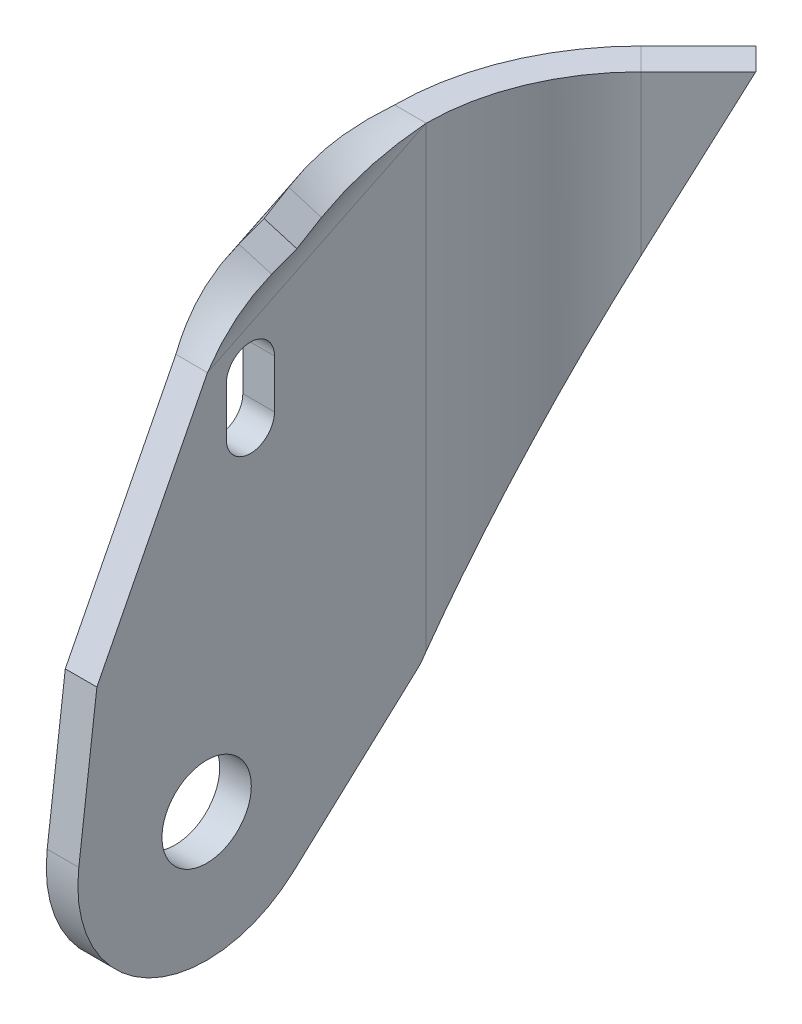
ISO-10303-21;
HEADER;
FILE_DESCRIPTION(('STEP AP214'),'2;1');
FILE_NAME('part.step','',(''),(''),'','','');
FILE_SCHEMA(('AUTOMOTIVE_DESIGN { 1 0 10303 214 1 1 1 1 }'));
ENDSEC;
DATA;
#1=APPLICATION_CONTEXT('core data for automotive mechanical design processes');
#2=APPLICATION_PROTOCOL_DEFINITION('international standard','automotive_design',2000,#1);
#3=PRODUCT_CONTEXT('',#1,'mechanical');
#4=PRODUCT('Part','Part','',(#3));
#5=PRODUCT_RELATED_PRODUCT_CATEGORY('part','',(#4));
#6=PRODUCT_DEFINITION_FORMATION('','',#4);
#7=PRODUCT_DEFINITION_CONTEXT('part definition',#1,'design');
#8=PRODUCT_DEFINITION('design','',#6,#7);
#9=PRODUCT_DEFINITION_SHAPE('','',#8);
#10=(LENGTH_UNIT() NAMED_UNIT(*) SI_UNIT(.MILLI.,.METRE.));
#11=(NAMED_UNIT(*) PLANE_ANGLE_UNIT() SI_UNIT($,.RADIAN.));
#12=(NAMED_UNIT(*) SI_UNIT($,.STERADIAN.) SOLID_ANGLE_UNIT());
#13=UNCERTAINTY_MEASURE_WITH_UNIT(LENGTH_MEASURE(1.E-05),#10,'distance_accuracy_value','');
#14=(GEOMETRIC_REPRESENTATION_CONTEXT(3) GLOBAL_UNCERTAINTY_ASSIGNED_CONTEXT((#13)) GLOBAL_UNIT_ASSIGNED_CONTEXT((#10,
#11,#12)) REPRESENTATION_CONTEXT('',''));
#15=CARTESIAN_POINT('',(0.,0.,0.));
#16=DIRECTION('',(0.,0.,1.));
#17=DIRECTION('',(1.,0.,0.));
#18=AXIS2_PLACEMENT_3D('',#15,#16,#17);
#19=CARTESIAN_POINT('',(0.,-91.0082,64.6682441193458));
#20=DIRECTION('',(1.,0.,0.));
#21=DIRECTION('',(0.,0.,-1.));
#22=AXIS2_PLACEMENT_3D('',#19,#20,#21);
#23=PLANE('',#22);
#24=CARTESIAN_POINT('',(0.,-71.9582,45.6182441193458));
#25=DIRECTION('',(1.,0.,0.));
#26=DIRECTION('',(0.,0.,-1.));
#27=AXIS2_PLACEMENT_3D('',#24,#25,#26);
#28=CIRCLE('',#27,6.604);
#29=CARTESIAN_POINT('',(0.,-71.9582,39.0142441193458));
#30=VERTEX_POINT('',#29);
#31=EDGE_CURVE('E816',#30,#30,#28,.T.);
#32=ORIENTED_EDGE('',*,*,#31,.F.);
#33=EDGE_LOOP('',(#32));
#34=FACE_BOUND('',#33,.T.);
#35=CARTESIAN_POINT('',(0.,-25.7556,39.1511237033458));
#36=DIRECTION('',(1.,0.,0.));
#37=DIRECTION('',(0.,0.,-1.));
#38=AXIS2_PLACEMENT_3D('',#35,#36,#37);
#39=CIRCLE('',#38,3.556);
#40=CARTESIAN_POINT('',(0.,-25.7556,42.7071237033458));
#41=VERTEX_POINT('',#40);
#42=CARTESIAN_POINT('',(0.,-25.7556,35.5951237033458));
#43=VERTEX_POINT('',#42);
#44=EDGE_CURVE('E776',#41,#43,#39,.T.);
#45=ORIENTED_EDGE('',*,*,#44,.F.);
#46=DIRECTION('',(0.,-1.,0.));
#47=VECTOR('',#46,1.);
#48=CARTESIAN_POINT('',(0.,-91.0082,42.7071237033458));
#49=LINE('',#48,#47);
#50=CARTESIAN_POINT('',(0.,-18.5928,42.7071237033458));
#51=VERTEX_POINT('',#50);
#52=EDGE_CURVE('E774',#51,#41,#49,.T.);
#53=ORIENTED_EDGE('',*,*,#52,.F.);
#54=CARTESIAN_POINT('',(0.,-18.5928,39.1511237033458));
#55=DIRECTION('',(1.,0.,0.));
#56=DIRECTION('',(0.,0.,-1.));
#57=AXIS2_PLACEMENT_3D('',#54,#55,#56);
#58=CIRCLE('',#57,3.556);
#59=CARTESIAN_POINT('',(0.,-18.5928,35.5951237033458));
#60=VERTEX_POINT('',#59);
#61=EDGE_CURVE('E772',#60,#51,#58,.T.);
#62=ORIENTED_EDGE('',*,*,#61,.F.);
#63=DIRECTION('',(0.,1.,0.));
#64=VECTOR('',#63,1.);
#65=CARTESIAN_POINT('',(0.,-91.0082,35.5951237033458));
#66=LINE('',#65,#64);
#67=EDGE_CURVE('E769',#43,#60,#66,.T.);
#68=ORIENTED_EDGE('',*,*,#67,.F.);
#69=EDGE_LOOP('',(#45,#53,#62,#68));
#70=FACE_BOUND('',#69,.T.);
#71=DIRECTION('',(0.,-0.675178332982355,0.737654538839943));
#72=VECTOR('',#71,1.);
#73=CARTESIAN_POINT('',(0.,-104.182583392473,52.6096750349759));
#74=LINE('',#73,#72);
#75=CARTESIAN_POINT('',(0.,-68.8898703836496,14.05122511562));
#76=VERTEX_POINT('',#75);
#77=CARTESIAN_POINT('',(0.,-86.0105189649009,32.756096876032));
#78=VERTEX_POINT('',#77);
#79=EDGE_CURVE('E757',#76,#78,#74,.T.);
#80=ORIENTED_EDGE('',*,*,#79,.F.);
#81=DIRECTION('',(0.,-0.811311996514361,0.584613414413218));
#82=VECTOR('',#81,1.);
#83=CARTESIAN_POINT('',(0.,-107.456603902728,41.8415571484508));
#84=LINE('',#83,#82);
#85=CARTESIAN_POINT('',(0.,-67.6409497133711,13.1512806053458));
#86=VERTEX_POINT('',#85);
#87=EDGE_CURVE('E430',#86,#76,#84,.T.);
#88=ORIENTED_EDGE('',*,*,#87,.F.);
#89=DIRECTION('',(0.,1.,0.));
#90=VECTOR('',#89,1.);
#91=CARTESIAN_POINT('',(0.,-91.0082,13.1512806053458));
#92=LINE('',#91,#90);
#93=CARTESIAN_POINT('',(0.,0.,13.1512806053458));
#94=VERTEX_POINT('',#93);
#95=EDGE_CURVE('E417',#86,#94,#92,.T.);
#96=ORIENTED_EDGE('',*,*,#95,.T.);
#97=DIRECTION('',(0.,-0.438371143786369,0.898794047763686));
#98=VECTOR('',#97,1.);
#99=CARTESIAN_POINT('',(0.,-37.7869389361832,90.6259873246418));
#100=LINE('',#99,#98);
#101=CARTESIAN_POINT('',(0.,-15.7774248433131,45.4997956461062));
#102=VERTEX_POINT('',#101);
#103=EDGE_CURVE('E423',#94,#102,#100,.T.);
#104=ORIENTED_EDGE('',*,*,#103,.T.);
#105=DIRECTION('',(0.,0.891006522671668,-0.453990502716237));
#106=VECTOR('',#105,1.);
#107=CARTESIAN_POINT('',(0.,-83.2563826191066,79.8820422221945));
#108=LINE('',#107,#106);
#109=CARTESIAN_POINT('',(0.,-47.874829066,61.8542400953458));
#110=VERTEX_POINT('',#109);
#111=EDGE_CURVE('E805',#110,#102,#108,.T.);
#112=ORIENTED_EDGE('',*,*,#111,.F.);
#113=DIRECTION('',(0.,0.992546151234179,-0.121869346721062));
#114=VECTOR('',#113,1.);
#115=CARTESIAN_POINT('',(0.,-90.707961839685,67.1134876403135));
#116=LINE('',#115,#114);
#117=CARTESIAN_POINT('',(0.,-69.6365889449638,64.5262483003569));
#118=VERTEX_POINT('',#117);
#119=EDGE_CURVE('E803',#118,#110,#116,.T.);
#120=ORIENTED_EDGE('',*,*,#119,.F.);
#121=CARTESIAN_POINT('',(0.,-71.9582,45.6182441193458));
#122=DIRECTION('',(1.,0.,0.));
#123=DIRECTION('',(0.,0.,-1.));
#124=AXIS2_PLACEMENT_3D('',#121,#122,#123);
#125=CIRCLE('',#124,19.05);
#126=EDGE_CURVE('E799',#78,#118,#125,.F.);
#127=ORIENTED_EDGE('',*,*,#126,.F.);
#128=EDGE_LOOP('',(#80,#88,#96,#104,#112,#120,#127));
#129=FACE_BOUND('',#128,.T.);
#130=ADVANCED_FACE('F414',(#34,#70,#129),#23,.T.);
#131=CARTESIAN_POINT('',(-4.6736,-91.0082,64.6682441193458));
#132=DIRECTION('',(1.,0.,0.));
#133=DIRECTION('',(0.,0.,-1.));
#134=AXIS2_PLACEMENT_3D('',#131,#132,#133);
#135=PLANE('',#134);
#136=DIRECTION('',(0.,1.,0.));
#137=VECTOR('',#136,1.);
#138=CARTESIAN_POINT('',(-4.6736,-91.0082,42.7071237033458));
#139=LINE('',#138,#137);
#140=CARTESIAN_POINT('',(-4.6736,-18.5928,42.7071237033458));
#141=VERTEX_POINT('',#140);
#142=CARTESIAN_POINT('',(-4.6736,-25.7556,42.7071237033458));
#143=VERTEX_POINT('',#142);
#144=EDGE_CURVE('E786',#141,#143,#139,.F.);
#145=ORIENTED_EDGE('',*,*,#144,.T.);
#146=CARTESIAN_POINT('',(-4.6736,-25.7556,39.1511237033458));
#147=DIRECTION('',(1.,0.,0.));
#148=DIRECTION('',(0.,0.,-1.));
#149=AXIS2_PLACEMENT_3D('',#146,#147,#148);
#150=CIRCLE('',#149,3.556);
#151=CARTESIAN_POINT('',(-4.6736,-25.7556,35.5951237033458));
#152=VERTEX_POINT('',#151);
#153=EDGE_CURVE('E782',#143,#152,#150,.T.);
#154=ORIENTED_EDGE('',*,*,#153,.T.);
#155=DIRECTION('',(0.,1.,0.));
#156=VECTOR('',#155,1.);
#157=CARTESIAN_POINT('',(-4.6736,-91.0082,35.5951237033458));
#158=LINE('',#157,#156);
#159=CARTESIAN_POINT('',(-4.6736,-18.5928,35.5951237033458));
#160=VERTEX_POINT('',#159);
#161=EDGE_CURVE('E778',#152,#160,#158,.T.);
#162=ORIENTED_EDGE('',*,*,#161,.T.);
#163=CARTESIAN_POINT('',(-4.6736,-18.5928,39.1511237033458));
#164=DIRECTION('',(1.,0.,0.));
#165=DIRECTION('',(0.,0.,-1.));
#166=AXIS2_PLACEMENT_3D('',#163,#164,#165);
#167=CIRCLE('',#166,3.556);
#168=EDGE_CURVE('E781',#160,#141,#167,.T.);
#169=ORIENTED_EDGE('',*,*,#168,.T.);
#170=EDGE_LOOP('',(#145,#154,#162,#169));
#171=FACE_BOUND('',#170,.T.);
#172=CARTESIAN_POINT('',(-4.6736,-71.9582,45.6182441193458));
#173=DIRECTION('',(1.,0.,0.));
#174=DIRECTION('',(0.,0.,-1.));
#175=AXIS2_PLACEMENT_3D('',#172,#173,#174);
#176=CIRCLE('',#175,6.604);
#177=CARTESIAN_POINT('',(-4.6736,-71.9582,39.0142441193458));
#178=VERTEX_POINT('',#177);
#179=EDGE_CURVE('E819',#178,#178,#176,.T.);
#180=ORIENTED_EDGE('',*,*,#179,.T.);
#181=EDGE_LOOP('',(#180));
#182=FACE_BOUND('',#181,.T.);
#183=DIRECTION('',(0.,-0.811311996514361,0.584613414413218));
#184=VECTOR('',#183,1.);
#185=CARTESIAN_POINT('',(-4.6736,-107.456603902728,41.8415571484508));
#186=LINE('',#185,#184);
#187=CARTESIAN_POINT('',(-4.6736,-67.6409497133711,13.1512806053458));
#188=VERTEX_POINT('',#187);
#189=CARTESIAN_POINT('',(-4.6736,-68.8898703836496,14.05122511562));
#190=VERTEX_POINT('',#189);
#191=EDGE_CURVE('E532',#188,#190,#186,.T.);
#192=ORIENTED_EDGE('',*,*,#191,.T.);
#193=DIRECTION('',(0.,-0.675178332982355,0.737654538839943));
#194=VECTOR('',#193,1.);
#195=CARTESIAN_POINT('',(-4.6736,-104.182583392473,52.6096750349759));
#196=LINE('',#195,#194);
#197=CARTESIAN_POINT('',(-4.6736,-86.0105189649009,32.756096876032));
#198=VERTEX_POINT('',#197);
#199=EDGE_CURVE('E764',#190,#198,#196,.T.);
#200=ORIENTED_EDGE('',*,*,#199,.T.);
#201=CARTESIAN_POINT('',(-4.6736,-71.9582,45.6182441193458));
#202=DIRECTION('',(1.,0.,0.));
#203=DIRECTION('',(0.,0.,-1.));
#204=AXIS2_PLACEMENT_3D('',#201,#202,#203);
#205=CIRCLE('',#204,19.05);
#206=CARTESIAN_POINT('',(-4.6736,-69.6365889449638,64.5262483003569));
#207=VERTEX_POINT('',#206);
#208=EDGE_CURVE('E808',#198,#207,#205,.F.);
#209=ORIENTED_EDGE('',*,*,#208,.T.);
#210=DIRECTION('',(0.,0.992546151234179,-0.121869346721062));
#211=VECTOR('',#210,1.);
#212=CARTESIAN_POINT('',(-4.6736,-90.707961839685,67.1134876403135));
#213=LINE('',#212,#211);
#214=CARTESIAN_POINT('',(-4.6736,-47.874829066,61.8542400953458));
#215=VERTEX_POINT('',#214);
#216=EDGE_CURVE('E626',#207,#215,#213,.T.);
#217=ORIENTED_EDGE('',*,*,#216,.T.);
#218=DIRECTION('',(0.,0.891006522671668,-0.453990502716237));
#219=VECTOR('',#218,1.);
#220=CARTESIAN_POINT('',(-4.6736,-83.2563826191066,79.8820422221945));
#221=LINE('',#220,#219);
#222=CARTESIAN_POINT('',(-4.6736,-15.7774248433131,45.4997956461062));
#223=VERTEX_POINT('',#222);
#224=EDGE_CURVE('E618',#215,#223,#221,.T.);
#225=ORIENTED_EDGE('',*,*,#224,.T.);
#226=DIRECTION('',(0.,-0.438371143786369,0.898794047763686));
#227=VECTOR('',#226,1.);
#228=CARTESIAN_POINT('',(-4.6736,-37.7869389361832,90.6259873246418));
#229=LINE('',#228,#227);
#230=CARTESIAN_POINT('',(-4.67360000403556,0.,13.1512806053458));
#231=VERTEX_POINT('',#230);
#232=EDGE_CURVE('E561',#231,#223,#229,.T.);
#233=ORIENTED_EDGE('',*,*,#232,.F.);
#234=DIRECTION('',(0.,1.,0.));
#235=VECTOR('',#234,1.);
#236=CARTESIAN_POINT('',(-4.6736,-91.0082,13.1512806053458));
#237=LINE('',#236,#235);
#238=EDGE_CURVE('E554',#188,#231,#237,.T.);
#239=ORIENTED_EDGE('',*,*,#238,.F.);
#240=EDGE_LOOP('',(#192,#200,#209,#217,#225,#233,#239));
#241=FACE_BOUND('',#240,.T.);
#242=ADVANCED_FACE('F559',(#171,#182,#241),#135,.F.);
#243=CARTESIAN_POINT('',(0.,-91.0082,0.));
#244=DIRECTION('',(0.707106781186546,0.,0.707106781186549));
#245=DIRECTION('',(0.707106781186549,0.,-0.707106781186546));
#246=AXIS2_PLACEMENT_3D('',#243,#244,#245);
#247=PLANE('',#246);
#248=DIRECTION('',(0.,1.,0.));
#249=VECTOR('',#248,1.);
#250=CARTESIAN_POINT('',(9.29935969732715,-91.0082,-9.29935969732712));
#251=LINE('',#250,#249);
#252=CARTESIAN_POINT('',(9.29935969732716,-23.5790872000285,-9.29935969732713));
#253=VERTEX_POINT('',#252);
#254=CARTESIAN_POINT('',(9.29935969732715,0.,-9.29935969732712));
#255=VERTEX_POINT('',#254);
#256=EDGE_CURVE('E562',#253,#255,#251,.T.);
#257=ORIENTED_EDGE('',*,*,#256,.F.);
#258=DIRECTION('',(-0.321019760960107,-0.891006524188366,0.321019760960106));
#259=VECTOR('',#258,1.);
#260=CARTESIAN_POINT('',(-11.9041033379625,-82.4303673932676,11.9041033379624));
#261=LINE('',#260,#259);
#262=CARTESIAN_POINT('',(17.7946431,0.,-17.7946430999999));
#263=VERTEX_POINT('',#262);
#264=EDGE_CURVE('E891',#263,#253,#261,.T.);
#265=ORIENTED_EDGE('',*,*,#264,.F.);
#266=DIRECTION('',(0.707106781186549,0.,-0.707106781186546));
#267=VECTOR('',#266,1.);
#268=CARTESIAN_POINT('',(0.,0.,0.));
#269=LINE('',#268,#267);
#270=EDGE_CURVE('E822',#255,#263,#269,.T.);
#271=ORIENTED_EDGE('',*,*,#270,.F.);
#272=EDGE_LOOP('',(#257,#265,#271));
#273=FACE_BOUND('',#272,.T.);
#274=ADVANCED_FACE('F603',(#273),#247,.T.);
#275=CARTESIAN_POINT('',(31.75,-91.0082,13.1512806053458));
#276=DIRECTION('',(0.,1.,0.));
#277=DIRECTION('',(0.,0.,1.));
#278=AXIS2_PLACEMENT_3D('',#275,#276,#277);
#279=CYLINDRICAL_SURFACE('',#278,31.75);
#280=ORIENTED_EDGE('',*,*,#95,.F.);
#281=CARTESIAN_POINT('',(31.75,-23.5790872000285,13.1512806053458));
#282=DIRECTION('',(-0.63003675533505,0.453990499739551,0.630036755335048));
#283=DIRECTION('',(0.321019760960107,0.891006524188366,-0.321019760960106));
#284=AXIS2_PLACEMENT_3D('',#281,#282,#283);
#285=ELLIPSE('',#284,69.9353841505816,31.75);
#286=EDGE_CURVE('E548',#253,#86,#285,.T.);
#287=ORIENTED_EDGE('',*,*,#286,.F.);
#288=ORIENTED_EDGE('',*,*,#256,.T.);
#289=CARTESIAN_POINT('',(31.75,0.,13.1512806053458));
#290=DIRECTION('',(0.,1.,0.));
#291=DIRECTION('',(0.,0.,1.));
#292=AXIS2_PLACEMENT_3D('',#289,#290,#291);
#293=CIRCLE('',#292,31.75);
#294=EDGE_CURVE('E563',#94,#255,#293,.F.);
#295=ORIENTED_EDGE('',*,*,#294,.F.);
#296=EDGE_LOOP('',(#280,#287,#288,#295));
#297=FACE_BOUND('',#296,.T.);
#298=ADVANCED_FACE('F970',(#297),#279,.F.);
#299=CARTESIAN_POINT('',(31.75,-91.0082,13.1512806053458));
#300=DIRECTION('',(0.,1.,0.));
#301=DIRECTION('',(0.,0.,1.));
#302=AXIS2_PLACEMENT_3D('',#299,#300,#301);
#303=CYLINDRICAL_SURFACE('',#302,36.4236);
#304=CARTESIAN_POINT('',(31.75,-23.5790872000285,13.1512806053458));
#305=DIRECTION('',(-0.610466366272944,0.504640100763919,0.610466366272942));
#306=DIRECTION('',(0.35683443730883,0.863329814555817,-0.356834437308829));
#307=AXIS2_PLACEMENT_3D('',#304,#305,#306);
#308=ELLIPSE('',#307,72.1773793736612,36.4236);
#309=CARTESIAN_POINT('',(5.99462544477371,-23.5790872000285,-12.6040939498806));
#310=VERTEX_POINT('',#309);
#311=EDGE_CURVE('E545',#310,#188,#308,.T.);
#312=ORIENTED_EDGE('',*,*,#311,.T.);
#313=ORIENTED_EDGE('',*,*,#238,.T.);
#314=CARTESIAN_POINT('',(31.75,0.,13.1512806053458));
#315=DIRECTION('',(0.,1.,0.));
#316=DIRECTION('',(1.,0.,0.));
#317=AXIS2_PLACEMENT_3D('',#314,#315,#316);
#318=CIRCLE('',#317,36.4236);
#319=CARTESIAN_POINT('',(5.99462544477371,0.,-12.6040939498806));
#320=VERTEX_POINT('',#319);
#321=EDGE_CURVE('E830',#231,#320,#318,.F.);
#322=ORIENTED_EDGE('',*,*,#321,.T.);
#323=DIRECTION('',(0.,1.,0.));
#324=VECTOR('',#323,1.);
#325=CARTESIAN_POINT('',(5.99462544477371,-91.0082,-12.6040939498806));
#326=LINE('',#325,#324);
#327=EDGE_CURVE('E556',#310,#320,#326,.T.);
#328=ORIENTED_EDGE('',*,*,#327,.F.);
#329=EDGE_LOOP('',(#312,#313,#322,#328));
#330=FACE_BOUND('',#329,.T.);
#331=ADVANCED_FACE('F552',(#330),#303,.T.);
#332=CARTESIAN_POINT('',(-3.30473425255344,-91.0082,-3.30473425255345));
#333=DIRECTION('',(0.707106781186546,0.,0.707106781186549));
#334=DIRECTION('',(0.707106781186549,0.,-0.707106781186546));
#335=AXIS2_PLACEMENT_3D('',#332,#333,#334);
#336=PLANE('',#335);
#337=DIRECTION('',(-0.321019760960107,-0.891006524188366,0.321019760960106));
#338=VECTOR('',#337,1.);
#339=CARTESIAN_POINT('',(-15.2088375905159,-82.4303673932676,8.59936908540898));
#340=LINE('',#339,#338);
#341=CARTESIAN_POINT('',(14.4899088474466,0.,-21.0993773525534));
#342=VERTEX_POINT('',#341);
#343=EDGE_CURVE('E886',#342,#310,#340,.T.);
#344=ORIENTED_EDGE('',*,*,#343,.T.);
#345=ORIENTED_EDGE('',*,*,#327,.T.);
#346=DIRECTION('',(0.707106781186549,0.,-0.707106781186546));
#347=VECTOR('',#346,1.);
#348=CARTESIAN_POINT('',(-3.30473425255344,0.,-3.30473425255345));
#349=LINE('',#348,#347);
#350=EDGE_CURVE('E827',#320,#342,#349,.T.);
#351=ORIENTED_EDGE('',*,*,#350,.T.);
#352=EDGE_LOOP('',(#344,#345,#351));
#353=FACE_BOUND('',#352,.T.);
#354=ADVANCED_FACE('F975',(#353),#336,.F.);
#355=CARTESIAN_POINT('',(0.,-104.182583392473,52.6096750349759));
#356=DIRECTION('',(0.,0.737654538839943,0.675178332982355));
#357=DIRECTION('',(0.,-0.675178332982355,0.737654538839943));
#358=AXIS2_PLACEMENT_3D('',#355,#356,#357);
#359=PLANE('',#358);
#360=ORIENTED_EDGE('',*,*,#199,.F.);
#361=DIRECTION('',(1.,0.,0.));
#362=VECTOR('',#361,1.);
#363=CARTESIAN_POINT('',(0.,-68.8898703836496,14.05122511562));
#364=LINE('',#363,#362);
#365=EDGE_CURVE('E537',#76,#190,#364,.F.);
#366=ORIENTED_EDGE('',*,*,#365,.F.);
#367=ORIENTED_EDGE('',*,*,#79,.T.);
#368=DIRECTION('',(1.,0.,0.));
#369=VECTOR('',#368,1.);
#370=CARTESIAN_POINT('',(0.,-86.0105189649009,32.756096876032));
#371=LINE('',#370,#369);
#372=EDGE_CURVE('E766',#78,#198,#371,.F.);
#373=ORIENTED_EDGE('',*,*,#372,.T.);
#374=EDGE_LOOP('',(#360,#366,#367,#373));
#375=FACE_BOUND('',#374,.T.);
#376=ADVANCED_FACE('F609',(#375),#359,.F.);
#377=CARTESIAN_POINT('',(0.,-83.2563826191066,79.8820422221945));
#378=DIRECTION('',(0.,-0.453990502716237,-0.891006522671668));
#379=DIRECTION('',(0.,0.891006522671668,-0.453990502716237));
#380=AXIS2_PLACEMENT_3D('',#377,#378,#379);
#381=PLANE('',#380);
#382=ORIENTED_EDGE('',*,*,#111,.T.);
#383=CARTESIAN_POINT('',(-4.67360000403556,-15.7774248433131,45.4997956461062));
#384=CARTESIAN_POINT('',(-4.03556181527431E-09,-15.7774248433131,45.4997956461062));
#385=B_SPLINE_CURVE_WITH_KNOTS('',1,(#383,#384),.UNSPECIFIED.,.F.,.F.,(2,2),(0.,1.),.UNSPECIFIED.);
#386=EDGE_CURVE('E577',#102,#223,#385,.F.);
#387=ORIENTED_EDGE('',*,*,#386,.T.);
#388=ORIENTED_EDGE('',*,*,#224,.F.);
#389=DIRECTION('',(1.,0.,0.));
#390=VECTOR('',#389,1.);
#391=CARTESIAN_POINT('',(0.,-47.874829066,61.8542400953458));
#392=LINE('',#391,#390);
#393=EDGE_CURVE('E625',#110,#215,#392,.F.);
#394=ORIENTED_EDGE('',*,*,#393,.F.);
#395=EDGE_LOOP('',(#382,#387,#388,#394));
#396=FACE_BOUND('',#395,.T.);
#397=ADVANCED_FACE('F602',(#396),#381,.F.);
#398=CARTESIAN_POINT('',(0.,0.,13.1512806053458));
#399=DIRECTION('',(0.,1.,0.));
#400=DIRECTION('',(0.,0.,1.));
#401=AXIS2_PLACEMENT_3D('',#398,#399,#400);
#402=PLANE('',#401);
#403=CARTESIAN_POINT('',(-4.03556181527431E-09,0.,13.1512806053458));
#404=CARTESIAN_POINT('',(-4.67360000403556,0.,13.1512806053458));
#405=B_SPLINE_CURVE_WITH_KNOTS('',1,(#403,#404),.UNSPECIFIED.,.F.,.F.,(2,2),(0.,1.),.UNSPECIFIED.);
#406=EDGE_CURVE('E12',#94,#231,#405,.T.);
#407=ORIENTED_EDGE('',*,*,#406,.F.);
#408=ORIENTED_EDGE('',*,*,#294,.T.);
#409=DIRECTION('',(0.707106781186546,0.,0.707106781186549));
#410=VECTOR('',#409,1.);
#411=CARTESIAN_POINT('',(5.99462544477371,0.,-12.6040939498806));
#412=LINE('',#411,#410);
#413=EDGE_CURVE('E578',#320,#255,#412,.T.);
#414=ORIENTED_EDGE('',*,*,#413,.F.);
#415=ORIENTED_EDGE('',*,*,#321,.F.);
#416=EDGE_LOOP('',(#407,#408,#414,#415));
#417=FACE_BOUND('',#416,.T.);
#418=ADVANCED_FACE('F591',(#417),#402,.T.);
#419=CARTESIAN_POINT('',(31.75,0.,13.1512806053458));
#420=DIRECTION('',(0.,1.,0.));
#421=DIRECTION('',(0.,0.,1.));
#422=AXIS2_PLACEMENT_3D('',#419,#420,#421);
#423=PLANE('',#422);
#424=ORIENTED_EDGE('',*,*,#270,.T.);
#425=DIRECTION('',(0.707106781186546,0.,0.707106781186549));
#426=VECTOR('',#425,1.);
#427=CARTESIAN_POINT('',(14.4899088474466,0.,-21.0993773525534));
#428=LINE('',#427,#426);
#429=EDGE_CURVE('E825',#342,#263,#428,.T.);
#430=ORIENTED_EDGE('',*,*,#429,.F.);
#431=ORIENTED_EDGE('',*,*,#350,.F.);
#432=ORIENTED_EDGE('',*,*,#413,.T.);
#433=EDGE_LOOP('',(#424,#430,#431,#432));
#434=FACE_BOUND('',#433,.T.);
#435=ADVANCED_FACE('F601',(#434),#423,.T.);
#436=CARTESIAN_POINT('',(0.,-71.9582,45.6182441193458));
#437=DIRECTION('',(1.,0.,0.));
#438=DIRECTION('',(0.,0.,-1.));
#439=AXIS2_PLACEMENT_3D('',#436,#437,#438);
#440=CYLINDRICAL_SURFACE('',#439,6.604);
#441=ORIENTED_EDGE('',*,*,#179,.F.);
#442=EDGE_LOOP('',(#441));
#443=FACE_BOUND('',#442,.T.);
#444=ORIENTED_EDGE('',*,*,#31,.T.);
#445=EDGE_LOOP('',(#444));
#446=FACE_BOUND('',#445,.T.);
#447=ADVANCED_FACE('F959',(#443,#446),#440,.F.);
#448=CARTESIAN_POINT('',(0.,-90.707961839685,67.1134876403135));
#449=DIRECTION('',(0.,-0.121869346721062,-0.992546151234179));
#450=DIRECTION('',(0.,0.992546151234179,-0.121869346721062));
#451=AXIS2_PLACEMENT_3D('',#448,#449,#450);
#452=PLANE('',#451);
#453=DIRECTION('',(1.,0.,0.));
#454=VECTOR('',#453,1.);
#455=CARTESIAN_POINT('',(0.,-69.6365889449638,64.5262483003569));
#456=LINE('',#455,#454);
#457=EDGE_CURVE('E813',#118,#207,#456,.F.);
#458=ORIENTED_EDGE('',*,*,#457,.F.);
#459=ORIENTED_EDGE('',*,*,#119,.T.);
#460=ORIENTED_EDGE('',*,*,#393,.T.);
#461=ORIENTED_EDGE('',*,*,#216,.F.);
#462=EDGE_LOOP('',(#458,#459,#460,#461));
#463=FACE_BOUND('',#462,.T.);
#464=ADVANCED_FACE('F956',(#463),#452,.F.);
#465=CARTESIAN_POINT('',(0.,-71.9582,45.6182441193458));
#466=DIRECTION('',(1.,0.,0.));
#467=DIRECTION('',(0.,0.,-1.));
#468=AXIS2_PLACEMENT_3D('',#465,#466,#467);
#469=CYLINDRICAL_SURFACE('',#468,19.05);
#470=ORIENTED_EDGE('',*,*,#126,.T.);
#471=ORIENTED_EDGE('',*,*,#457,.T.);
#472=ORIENTED_EDGE('',*,*,#208,.F.);
#473=ORIENTED_EDGE('',*,*,#372,.F.);
#474=EDGE_LOOP('',(#470,#471,#472,#473));
#475=FACE_BOUND('',#474,.T.);
#476=ADVANCED_FACE('F958',(#475),#469,.T.);
#477=CARTESIAN_POINT('',(0.,-91.0082,42.7071237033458));
#478=DIRECTION('',(0.,0.,1.));
#479=DIRECTION('',(0.,-1.,0.));
#480=AXIS2_PLACEMENT_3D('',#477,#478,#479);
#481=PLANE('',#480);
#482=DIRECTION('',(1.,0.,0.));
#483=VECTOR('',#482,1.);
#484=CARTESIAN_POINT('',(0.,-18.5928,42.7071237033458));
#485=LINE('',#484,#483);
#486=EDGE_CURVE('E797',#51,#141,#485,.F.);
#487=ORIENTED_EDGE('',*,*,#486,.F.);
#488=ORIENTED_EDGE('',*,*,#52,.T.);
#489=DIRECTION('',(1.,0.,0.));
#490=VECTOR('',#489,1.);
#491=CARTESIAN_POINT('',(0.,-25.7556,42.7071237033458));
#492=LINE('',#491,#490);
#493=EDGE_CURVE('E794',#41,#143,#492,.F.);
#494=ORIENTED_EDGE('',*,*,#493,.T.);
#495=ORIENTED_EDGE('',*,*,#144,.F.);
#496=EDGE_LOOP('',(#487,#488,#494,#495));
#497=FACE_BOUND('',#496,.T.);
#498=ADVANCED_FACE('F942',(#497),#481,.F.);
#499=CARTESIAN_POINT('',(0.,-25.7556,39.1511237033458));
#500=DIRECTION('',(1.,0.,0.));
#501=DIRECTION('',(0.,0.,-1.));
#502=AXIS2_PLACEMENT_3D('',#499,#500,#501);
#503=CYLINDRICAL_SURFACE('',#502,3.556);
#504=ORIENTED_EDGE('',*,*,#493,.F.);
#505=ORIENTED_EDGE('',*,*,#44,.T.);
#506=DIRECTION('',(1.,0.,0.));
#507=VECTOR('',#506,1.);
#508=CARTESIAN_POINT('',(0.,-25.7556,35.5951237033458));
#509=LINE('',#508,#507);
#510=EDGE_CURVE('E791',#43,#152,#509,.F.);
#511=ORIENTED_EDGE('',*,*,#510,.T.);
#512=ORIENTED_EDGE('',*,*,#153,.F.);
#513=EDGE_LOOP('',(#504,#505,#511,#512));
#514=FACE_BOUND('',#513,.T.);
#515=ADVANCED_FACE('F935',(#514),#503,.F.);
#516=CARTESIAN_POINT('',(0.,-91.0082,35.5951237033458));
#517=DIRECTION('',(0.,0.,-1.));
#518=DIRECTION('',(0.,1.,0.));
#519=AXIS2_PLACEMENT_3D('',#516,#517,#518);
#520=PLANE('',#519);
#521=ORIENTED_EDGE('',*,*,#510,.F.);
#522=ORIENTED_EDGE('',*,*,#67,.T.);
#523=DIRECTION('',(1.,0.,0.));
#524=VECTOR('',#523,1.);
#525=CARTESIAN_POINT('',(0.,-18.5928,35.5951237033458));
#526=LINE('',#525,#524);
#527=EDGE_CURVE('E785',#60,#160,#526,.F.);
#528=ORIENTED_EDGE('',*,*,#527,.T.);
#529=ORIENTED_EDGE('',*,*,#161,.F.);
#530=EDGE_LOOP('',(#521,#522,#528,#529));
#531=FACE_BOUND('',#530,.T.);
#532=ADVANCED_FACE('F937',(#531),#520,.F.);
#533=CARTESIAN_POINT('',(0.,-18.5928,39.1511237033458));
#534=DIRECTION('',(1.,0.,0.));
#535=DIRECTION('',(0.,0.,-1.));
#536=AXIS2_PLACEMENT_3D('',#533,#534,#535);
#537=CYLINDRICAL_SURFACE('',#536,3.556);
#538=ORIENTED_EDGE('',*,*,#61,.T.);
#539=ORIENTED_EDGE('',*,*,#486,.T.);
#540=ORIENTED_EDGE('',*,*,#168,.F.);
#541=ORIENTED_EDGE('',*,*,#527,.F.);
#542=EDGE_LOOP('',(#538,#539,#540,#541));
#543=FACE_BOUND('',#542,.T.);
#544=ADVANCED_FACE('F944',(#543),#537,.F.);
#545=CARTESIAN_POINT('',(-1.18971915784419,0.760510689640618,32.2955092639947));
#546=CARTESIAN_POINT('',(-2.29857887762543,0.886474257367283,29.2279515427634));
#547=CARTESIAN_POINT('',(-3.17885767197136,0.828105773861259,26.0707099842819));
#548=CARTESIAN_POINT('',(-4.36656528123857,0.512755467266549,19.659135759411));
#549=CARTESIAN_POINT('',(-4.67360000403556,0.256609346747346,16.4054316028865));
#550=CARTESIAN_POINT('',(-4.67360000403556,0.,13.1512806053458));
#551=CARTESIAN_POINT('',(2.28344249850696,-2.05024191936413,30.9246136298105));
#552=CARTESIAN_POINT('',(1.55667451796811,-1.54289142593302,28.0431255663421));
#553=CARTESIAN_POINT('',(0.979700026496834,-1.15637003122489,25.1028164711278));
#554=CARTESIAN_POINT('',(0.201239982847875,-0.513492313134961,19.1586012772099));
#555=CARTESIAN_POINT('',(-4.0355620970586E-09,-0.256604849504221,16.1550654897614));
#556=CARTESIAN_POINT('',(-4.03556181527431E-09,0.,13.1512806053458));
#557=B_SPLINE_SURFACE_WITH_KNOTS('',1,3,((#545,#546,#547,#548,#549,#550),(#551,#552,#553,#554,
#555,#556)),.UNSPECIFIED.,.F.,.F.,.F.,(2,2),(4,2,4),(0.,1.),(0.,0.5,1.),.UNSPECIFIED.);
#558=CARTESIAN_POINT('',(-1.18971915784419,0.760510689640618,32.2955092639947));
#559=CARTESIAN_POINT('',(2.28344249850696,-2.05024191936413,30.9246136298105));
#560=B_SPLINE_CURVE_WITH_KNOTS('',1,(#558,#559),.UNSPECIFIED.,.F.,.F.,(2,2),(0.,1.),.UNSPECIFIED.);
#561=CARTESIAN_POINT('',(-1.18971915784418,0.760510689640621,32.2955092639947));
#562=VERTEX_POINT('',#561);
#563=CARTESIAN_POINT('',(2.28344250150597,-2.05024192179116,30.9246136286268));
#564=VERTEX_POINT('',#563);
#565=EDGE_CURVE('E854',#562,#564,#560,.T.);
#566=CARTESIAN_POINT('',(2.28344249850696,-2.05024191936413,30.9246136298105));
#567=CARTESIAN_POINT('',(1.55667451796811,-1.54289142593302,28.0431255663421));
#568=CARTESIAN_POINT('',(0.979700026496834,-1.15637003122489,25.1028164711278));
#569=CARTESIAN_POINT('',(0.201239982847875,-0.513492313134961,19.1586012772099));
#570=CARTESIAN_POINT('',(-4.0355620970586E-09,-0.256604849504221,16.1550654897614));
#571=CARTESIAN_POINT('',(-4.03556181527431E-09,0.,13.1512806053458));
#572=B_SPLINE_CURVE_WITH_KNOTS('',3,(#566,#567,#568,#569,#570,#571),.UNSPECIFIED.,.F.,.F.,(4,2,
4),(0.,0.5,1.),.UNSPECIFIED.);
#573=EDGE_CURVE('E847',#564,#94,#572,.T.);
#574=CARTESIAN_POINT('',(-4.67360000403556,0.,13.1512806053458));
#575=CARTESIAN_POINT('',(-4.67360000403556,0.256609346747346,16.4054316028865));
#576=CARTESIAN_POINT('',(-4.36656528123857,0.512755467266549,19.659135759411));
#577=CARTESIAN_POINT('',(-3.17885767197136,0.828105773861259,26.0707099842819));
#578=CARTESIAN_POINT('',(-2.29857887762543,0.886474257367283,29.2279515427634));
#579=CARTESIAN_POINT('',(-1.18971915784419,0.760510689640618,32.2955092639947));
#580=B_SPLINE_CURVE_WITH_KNOTS('',3,(#574,#575,#576,#577,#578,#579),.UNSPECIFIED.,.F.,.F.,(4,2,
4),(0.,0.5,1.),.UNSPECIFIED.);
#581=EDGE_CURVE('E879',#562,#231,#580,.F.);
#582=ORIENTED_EDGE('',*,*,#565,.T.);
#583=ORIENTED_EDGE('',*,*,#573,.T.);
#584=ORIENTED_EDGE('',*,*,#406,.T.);
#585=ORIENTED_EDGE('',*,*,#581,.F.);
#586=EDGE_LOOP('',(#582,#583,#584,#585));
#587=FACE_BOUND('',#586,.T.);
#588=ADVANCED_FACE('F726',(#587),#557,.T.);
#589=CARTESIAN_POINT('',(-4.67360000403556,-15.7774248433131,45.4997956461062));
#590=CARTESIAN_POINT('',(-4.67360000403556,-13.4899662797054,44.5901898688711));
#591=CARTESIAN_POINT('',(-4.36656528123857,-11.2032368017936,43.6804799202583));
#592=CARTESIAN_POINT('',(-3.17885767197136,-6.82645392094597,41.764883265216));
#593=CARTESIAN_POINT('',(-2.29860856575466,-4.73749183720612,40.7587157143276));
#594=CARTESIAN_POINT('',(-1.18971915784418,-2.83261643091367,39.6625116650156));
#595=CARTESIAN_POINT('',(-4.03556181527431E-09,-15.7774248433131,45.4997956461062));
#596=CARTESIAN_POINT('',(-4.03556117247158E-09,-14.0032450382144,44.3398999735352));
#597=CARTESIAN_POINT('',(0.201239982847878,-12.2294845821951,43.1799454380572));
#598=CARTESIAN_POINT('',(0.979700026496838,-8.81092972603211,40.7969897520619));
#599=CARTESIAN_POINT('',(1.55666130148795,-7.16679864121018,39.5738107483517));
#600=CARTESIAN_POINT('',(2.28344249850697,-5.64336903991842,38.2916160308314));
#601=B_SPLINE_SURFACE_WITH_KNOTS('',1,3,((#589,#590,#591,#592,#593,#594),(#595,#596,#597,#598,
#599,#600)),.UNSPECIFIED.,.F.,.F.,.F.,(2,2),(4,2,4),(0.,1.),(0.,0.5,1.),.UNSPECIFIED.);
#602=CARTESIAN_POINT('',(-4.03556181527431E-09,-15.7774248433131,45.4997956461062));
#603=CARTESIAN_POINT('',(-4.03556117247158E-09,-14.0032450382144,44.3398999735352));
#604=CARTESIAN_POINT('',(0.201239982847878,-12.2294845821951,43.1799454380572));
#605=CARTESIAN_POINT('',(0.979700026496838,-8.81092972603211,40.7969897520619));
#606=CARTESIAN_POINT('',(1.55666130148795,-7.16679864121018,39.5738107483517));
#607=CARTESIAN_POINT('',(2.28344249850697,-5.64336903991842,38.2916160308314));
#608=B_SPLINE_CURVE_WITH_KNOTS('',3,(#602,#603,#604,#605,#606,#607),.UNSPECIFIED.,.F.,.F.,(4,2,
4),(0.,0.5,1.),.UNSPECIFIED.);
#609=CARTESIAN_POINT('',(2.28344250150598,-5.64336904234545,38.2916160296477));
#610=VERTEX_POINT('',#609);
#611=EDGE_CURVE('E848',#102,#610,#608,.T.);
#612=CARTESIAN_POINT('',(2.28344249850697,-5.64336903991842,38.2916160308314));
#613=CARTESIAN_POINT('',(-1.18971915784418,-2.83261643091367,39.6625116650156));
#614=B_SPLINE_CURVE_WITH_KNOTS('',1,(#612,#613),.UNSPECIFIED.,.F.,.F.,(2,2),(0.,1.),.UNSPECIFIED.);
#615=CARTESIAN_POINT('',(-1.18971915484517,-2.8326164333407,39.6625116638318));
#616=VERTEX_POINT('',#615);
#617=EDGE_CURVE('E633',#610,#616,#614,.T.);
#618=CARTESIAN_POINT('',(-1.18971915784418,-2.83261643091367,39.6625116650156));
#619=CARTESIAN_POINT('',(-2.29860856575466,-4.73749183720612,40.7587157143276));
#620=CARTESIAN_POINT('',(-3.17885767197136,-6.82645392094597,41.764883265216));
#621=CARTESIAN_POINT('',(-4.36656528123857,-11.2032368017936,43.6804799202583));
#622=CARTESIAN_POINT('',(-4.67360000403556,-13.4899662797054,44.5901898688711));
#623=CARTESIAN_POINT('',(-4.67360000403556,-15.7774248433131,45.4997956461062));
#624=B_SPLINE_CURVE_WITH_KNOTS('',3,(#618,#619,#620,#621,#622,#623),.UNSPECIFIED.,.F.,.F.,(4,2,
4),(0.,0.5,1.),.UNSPECIFIED.);
#625=EDGE_CURVE('E709',#223,#616,#624,.F.);
#626=ORIENTED_EDGE('',*,*,#611,.T.);
#627=ORIENTED_EDGE('',*,*,#617,.T.);
#628=ORIENTED_EDGE('',*,*,#625,.F.);
#629=ORIENTED_EDGE('',*,*,#386,.F.);
#630=EDGE_LOOP('',(#626,#627,#628,#629));
#631=FACE_BOUND('',#630,.T.);
#632=ADVANCED_FACE('F683',(#631),#601,.T.);
#633=CARTESIAN_POINT('',(8.89,-23.7986023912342,61.9456469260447));
#634=DIRECTION('',(0.,0.438371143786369,-0.898794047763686));
#635=DIRECTION('',(0.,0.898794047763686,0.438371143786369));
#636=AXIS2_PLACEMENT_3D('',#633,#634,#635);
#637=CYLINDRICAL_SURFACE('',#636,13.5636000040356);
#638=ORIENTED_EDGE('',*,*,#232,.T.);
#639=ORIENTED_EDGE('',*,*,#625,.T.);
#640=DIRECTION('',(0.,-0.43837114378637,0.898794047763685));
#641=VECTOR('',#640,1.);
#642=CARTESIAN_POINT('',(-1.18971915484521,-29.6296460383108,94.6045648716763));
#643=LINE('',#642,#641);
#644=EDGE_CURVE('E632',#562,#616,#643,.T.);
#645=ORIENTED_EDGE('',*,*,#644,.F.);
#646=ORIENTED_EDGE('',*,*,#581,.T.);
#647=EDGE_LOOP('',(#638,#639,#645,#646));
#648=FACE_BOUND('',#647,.T.);
#649=ADVANCED_FACE('F681',(#648),#637,.T.);
#650=CARTESIAN_POINT('',(8.89,-23.7986023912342,61.9456469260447));
#651=DIRECTION('',(0.,0.438371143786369,-0.898794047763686));
#652=DIRECTION('',(0.,0.898794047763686,0.438371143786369));
#653=AXIS2_PLACEMENT_3D('',#650,#651,#652);
#654=CYLINDRICAL_SURFACE('',#653,8.89000000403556);
#655=ORIENTED_EDGE('',*,*,#103,.F.);
#656=ORIENTED_EDGE('',*,*,#573,.F.);
#657=DIRECTION('',(0.,-0.43837114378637,0.898794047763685));
#658=VECTOR('',#657,1.);
#659=CARTESIAN_POINT('',(2.28344250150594,-32.4403986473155,93.2336692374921));
#660=LINE('',#659,#658);
#661=EDGE_CURVE('E654',#564,#610,#660,.T.);
#662=ORIENTED_EDGE('',*,*,#661,.T.);
#663=ORIENTED_EDGE('',*,*,#611,.F.);
#664=EDGE_LOOP('',(#655,#656,#662,#663));
#665=FACE_BOUND('',#664,.T.);
#666=ADVANCED_FACE('F677',(#665),#654,.F.);
#667=CARTESIAN_POINT('',(-46.3183981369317,-74.677631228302,72.6331946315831));
#668=DIRECTION('',(0.743144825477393,-0.601410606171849,-0.293327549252));
#669=DIRECTION('',(-0.293327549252,0.10120231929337,-0.950640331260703));
#670=AXIS2_PLACEMENT_3D('',#667,#668,#669);
#671=PLANE('',#670);
#672=DIRECTION('',(-0.293327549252,0.10120231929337,-0.950640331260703));
#673=VECTOR('',#672,1.);
#674=CARTESIAN_POINT('',(8.41489859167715,-2.5532237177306,63.4229537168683));
#675=LINE('',#674,#673);
#676=CARTESIAN_POINT('',(0.434204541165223,0.200233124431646,37.5584563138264));
#677=VERTEX_POINT('',#676);
#678=EDGE_CURVE('E629',#677,#562,#675,.T.);
#679=ORIENTED_EDGE('',*,*,#678,.T.);
#680=ORIENTED_EDGE('',*,*,#644,.T.);
#681=DIRECTION('',(0.402692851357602,0.752071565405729,-0.52175360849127));
#682=VECTOR('',#681,1.);
#683=CARTESIAN_POINT('',(-37.1937468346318,-70.0739527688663,86.3115428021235));
#684=LINE('',#683,#682);
#685=EDGE_CURVE('E637',#616,#677,#684,.T.);
#686=ORIENTED_EDGE('',*,*,#685,.T.);
#687=EDGE_LOOP('',(#679,#680,#686));
#688=FACE_BOUND('',#687,.T.);
#689=ADVANCED_FACE('F667',(#688),#671,.F.);
#690=CARTESIAN_POINT('',(-33.7205851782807,-72.8847053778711,84.9406471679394));
#691=DIRECTION('',(-0.534391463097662,-0.26961758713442,-0.801081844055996));
#692=DIRECTION('',(0.402692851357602,0.752071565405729,-0.52175360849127));
#693=AXIS2_PLACEMENT_3D('',#690,#691,#692);
#694=PLANE('',#693);
#695=ORIENTED_EDGE('',*,*,#617,.F.);
#696=DIRECTION('',(0.402692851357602,0.752071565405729,-0.52175360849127));
#697=VECTOR('',#696,1.);
#698=CARTESIAN_POINT('',(-33.7205851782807,-72.8847053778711,84.9406471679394));
#699=LINE('',#698,#697);
#700=CARTESIAN_POINT('',(3.90736619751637,-2.61051948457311,36.1875606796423));
#701=VERTEX_POINT('',#700);
#702=EDGE_CURVE('E641',#610,#701,#699,.T.);
#703=ORIENTED_EDGE('',*,*,#702,.T.);
#704=DIRECTION('',(0.743144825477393,-0.601410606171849,-0.293327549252));
#705=VECTOR('',#704,1.);
#706=CARTESIAN_POINT('',(3.90736619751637,-2.61051948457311,36.1875606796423));
#707=LINE('',#706,#705);
#708=EDGE_CURVE('E895',#701,#677,#707,.F.);
#709=ORIENTED_EDGE('',*,*,#708,.T.);
#710=ORIENTED_EDGE('',*,*,#685,.F.);
#711=EDGE_LOOP('',(#695,#703,#709,#710));
#712=FACE_BOUND('',#711,.T.);
#713=ADVANCED_FACE('F656',(#712),#694,.F.);
#714=CARTESIAN_POINT('',(-42.8452364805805,-77.4883838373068,71.2622989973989));
#715=DIRECTION('',(0.743144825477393,-0.601410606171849,-0.293327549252));
#716=DIRECTION('',(-0.293327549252,0.10120231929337,-0.950640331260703));
#717=AXIS2_PLACEMENT_3D('',#714,#715,#716);
#718=PLANE('',#717);
#719=ORIENTED_EDGE('',*,*,#661,.F.);
#720=DIRECTION('',(-0.293327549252,0.10120231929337,-0.950640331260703));
#721=VECTOR('',#720,1.);
#722=CARTESIAN_POINT('',(11.8880602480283,-5.36397632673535,62.0520580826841));
#723=LINE('',#722,#721);
#724=EDGE_CURVE('E856',#701,#564,#723,.T.);
#725=ORIENTED_EDGE('',*,*,#724,.F.);
#726=ORIENTED_EDGE('',*,*,#702,.F.);
#727=EDGE_LOOP('',(#719,#725,#726));
#728=FACE_BOUND('',#727,.T.);
#729=ADVANCED_FACE('F666',(#728),#718,.T.);
#730=CARTESIAN_POINT('',(-6.3231704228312,-1.14906781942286,-13.1645317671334));
#731=DIRECTION('',(0.601410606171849,0.792504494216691,-0.10120231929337));
#732=DIRECTION('',(0.293327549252,-0.10120231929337,0.950640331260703));
#733=AXIS2_PLACEMENT_3D('',#730,#731,#732);
#734=PLANE('',#733);
#735=ORIENTED_EDGE('',*,*,#565,.F.);
#736=ORIENTED_EDGE('',*,*,#678,.F.);
#737=ORIENTED_EDGE('',*,*,#708,.F.);
#738=ORIENTED_EDGE('',*,*,#724,.T.);
#739=EDGE_LOOP('',(#735,#736,#737,#738));
#740=FACE_BOUND('',#739,.T.);
#741=ADVANCED_FACE('F670',(#740),#734,.T.);
#742=CARTESIAN_POINT('',(-11.9041033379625,-82.4303673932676,11.9041033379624));
#743=DIRECTION('',(-0.63003675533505,0.453990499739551,0.630036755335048));
#744=DIRECTION('',(-0.321019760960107,-0.891006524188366,0.321019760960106));
#745=AXIS2_PLACEMENT_3D('',#742,#743,#744);
#746=PLANE('',#745);
#747=ORIENTED_EDGE('',*,*,#264,.T.);
#748=DIRECTION('',(0.707106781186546,0.,0.707106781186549));
#749=VECTOR('',#748,1.);
#750=CARTESIAN_POINT('',(9.29935969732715,-23.5790872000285,-9.29935969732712));
#751=LINE('',#750,#749);
#752=EDGE_CURVE('E885',#253,#310,#751,.F.);
#753=ORIENTED_EDGE('',*,*,#752,.T.);
#754=ORIENTED_EDGE('',*,*,#343,.F.);
#755=ORIENTED_EDGE('',*,*,#429,.T.);
#756=EDGE_LOOP('',(#747,#753,#754,#755));
#757=FACE_BOUND('',#756,.T.);
#758=ADVANCED_FACE('F675',(#757),#746,.F.);
#759=CARTESIAN_POINT('',(0.,-107.456603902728,41.8415571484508));
#760=DIRECTION('',(0.,0.584613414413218,0.811311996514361));
#761=DIRECTION('',(0.,-0.811311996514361,0.584613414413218));
#762=AXIS2_PLACEMENT_3D('',#759,#760,#761);
#763=PLANE('',#762);
#764=ORIENTED_EDGE('',*,*,#87,.T.);
#765=ORIENTED_EDGE('',*,*,#365,.T.);
#766=ORIENTED_EDGE('',*,*,#191,.F.);
#767=DIRECTION('',(1.,0.,0.));
#768=VECTOR('',#767,1.);
#769=CARTESIAN_POINT('',(0.,-67.6409497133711,13.1512806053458));
#770=LINE('',#769,#768);
#771=EDGE_CURVE('E535',#86,#188,#770,.F.);
#772=ORIENTED_EDGE('',*,*,#771,.F.);
#773=EDGE_LOOP('',(#764,#765,#766,#772));
#774=FACE_BOUND('',#773,.T.);
#775=ADVANCED_FACE('F534',(#774),#763,.F.);
#776=CARTESIAN_POINT('',(54.2006403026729,38.7337963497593,-9.29935969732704));
#777=CARTESIAN_POINT('',(55.3022183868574,38.7337963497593,-10.4009377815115));
#778=CARTESIAN_POINT('',(56.4037964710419,38.7337963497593,-11.502515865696));
#779=CARTESIAN_POINT('',(57.5053745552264,38.7337963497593,-12.6040939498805));
#780=CARTESIAN_POINT('',(9.29935969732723,38.7337963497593,-54.2006403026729));
#781=CARTESIAN_POINT('',(8.19778161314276,38.7337963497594,-57.5053745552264));
#782=CARTESIAN_POINT('',(7.09620352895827,38.7337963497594,-60.8101088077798));
#783=CARTESIAN_POINT('',(5.99462544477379,38.7337963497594,-64.1148430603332));
#784=CARTESIAN_POINT('',(-35.6019209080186,-85.8919707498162,-9.29935969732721));
#785=CARTESIAN_POINT('',(-38.9066551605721,-85.8919707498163,-10.4009377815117));
#786=CARTESIAN_POINT('',(-42.2113894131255,-85.8919707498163,-11.5025158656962));
#787=CARTESIAN_POINT('',(-45.516123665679,-85.8919707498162,-12.6040939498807));
#788=CARTESIAN_POINT('',(9.29935969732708,-85.8919707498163,35.6019209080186));
#789=CARTESIAN_POINT('',(8.19778161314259,-85.8919707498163,36.7034989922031));
#790=CARTESIAN_POINT('',(7.0962035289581,-85.8919707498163,37.8050770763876));
#791=CARTESIAN_POINT('',(5.99462544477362,-85.8919707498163,38.9066551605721));
#792=CARTESIAN_POINT('',(54.2006403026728,-85.8919707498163,80.5032015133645));
#793=CARTESIAN_POINT('',(55.3022183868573,-85.8919707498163,83.807935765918));
#794=CARTESIAN_POINT('',(56.4037964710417,-85.8919707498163,87.1126700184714));
#795=CARTESIAN_POINT('',(57.5053745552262,-85.8919707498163,90.4174042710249));
#796=CARTESIAN_POINT('',(99.1019209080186,38.7337963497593,35.6019209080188));
#797=CARTESIAN_POINT('',(102.406655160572,38.7337963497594,36.7034989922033));
#798=CARTESIAN_POINT('',(105.711389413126,38.7337963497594,37.8050770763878));
#799=CARTESIAN_POINT('',(109.016123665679,38.7337963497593,38.9066551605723));
#800=CARTESIAN_POINT('',(54.2006403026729,38.7337963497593,-9.29935969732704));
#801=CARTESIAN_POINT('',(55.3022183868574,38.7337963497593,-10.4009377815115));
#802=CARTESIAN_POINT('',(56.4037964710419,38.7337963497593,-11.502515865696));
#803=CARTESIAN_POINT('',(57.5053745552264,38.7337963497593,-12.6040939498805));
#804=(BOUNDED_SURFACE() B_SPLINE_SURFACE(3,3,((#776,#777,#778,#779),(#780,#781,#782,#783),(#784,
#785,#786,#787),(#788,#789,#790,#791),(#792,#793,#794,#795),(#796,#797,#798,#799),(#800,#801,
#802,#803)),.UNSPECIFIED.,.T.,.F.,.F.) B_SPLINE_SURFACE_WITH_KNOTS((4,3,4),(4,4),(0.,0.5,1.),
(0.,1.),.UNSPECIFIED.) GEOMETRIC_REPRESENTATION_ITEM() RATIONAL_B_SPLINE_SURFACE(((1.,1.,1.,1.),
(0.333333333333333,0.333333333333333,0.333333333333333,0.333333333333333),(0.333333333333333,
0.333333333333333,0.333333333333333,0.333333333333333),(1.,1.,1.,1.),(0.333333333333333,
0.333333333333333,0.333333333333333,0.333333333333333),(0.333333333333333,0.333333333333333,
0.333333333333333,0.333333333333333),(1.,1.,1.,1.))) REPRESENTATION_ITEM('') SURFACE());
#805=ORIENTED_EDGE('',*,*,#286,.T.);
#806=ORIENTED_EDGE('',*,*,#771,.T.);
#807=ORIENTED_EDGE('',*,*,#311,.F.);
#808=ORIENTED_EDGE('',*,*,#752,.F.);
#809=EDGE_LOOP('',(#805,#806,#807,#808));
#810=FACE_BOUND('',#809,.T.);
#811=ADVANCED_FACE('F544',(#810),#804,.T.);
#812=CLOSED_SHELL('',(#130,#242,#274,#298,#331,#354,#376,#397,#418,#435,#447,#464,#476,#498,
#515,#532,#544,#588,#632,#649,#666,#689,#713,#729,#741,#758,#775,#811));
#813=MANIFOLD_SOLID_BREP('B2',#812);
#814=ADVANCED_BREP_SHAPE_REPRESENTATION('',(#18,#813),#14);
#815=SHAPE_DEFINITION_REPRESENTATION(#9,#814);
ENDSEC;
END-ISO-10303-21;
